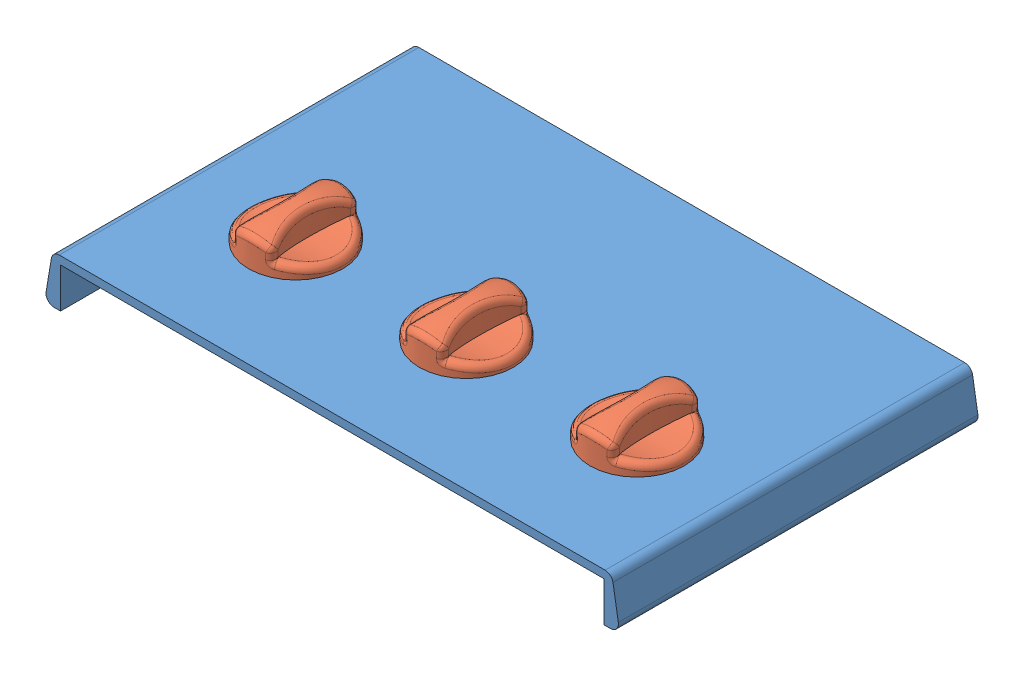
SolidWorks assembly Burner Panel Assembly.SLDASM, configuration Default (file format 14000). Lengths in mm.
Overall size (454.91 70.97 285.75).
4 component instances, 2 part files, 2 mates.
Components (placement in the parent):
- Panel, Table Top-1: Panel, Table Top.SLDPRT [Burner Tray] at origin size (454.91 38.1 285.75)
- Knob, Burner-8: Knob, Burner.SLDPRT [Default] at (140.6707 7.9375 184.15) size (74.93 31.48 74.93)
- Knob, Burner-9: Knob, Burner.SLDPRT [Default] at (5.0347 7.9375 184.15) size (74.93 31.48 74.93)
- Knob, Burner-10: Knob, Burner.SLDPRT [Default] at (-130.6013 7.9375 184.15) size (74.93 31.48 74.93)
Mates (geometry in assembly coordinates):
- Concentric1: concentric aligned: cylinder of Panel, Table Top-1 through (140.6707 -31.75 184.15) axis (0 1 0) radius 6.35; cone of Knob, Burner-8 through (140.6707 7.9375 184.15) axis (0 1 0)
- Distance1: distance = 1.5875 mm anti-aligned: plane of Panel, Table Top-1 through (216.8707 6.35 285.75) normal (0 1 0); plane of Knob, Burner-8 through (140.6707 7.9375 184.15) normal (0 -1 0)
